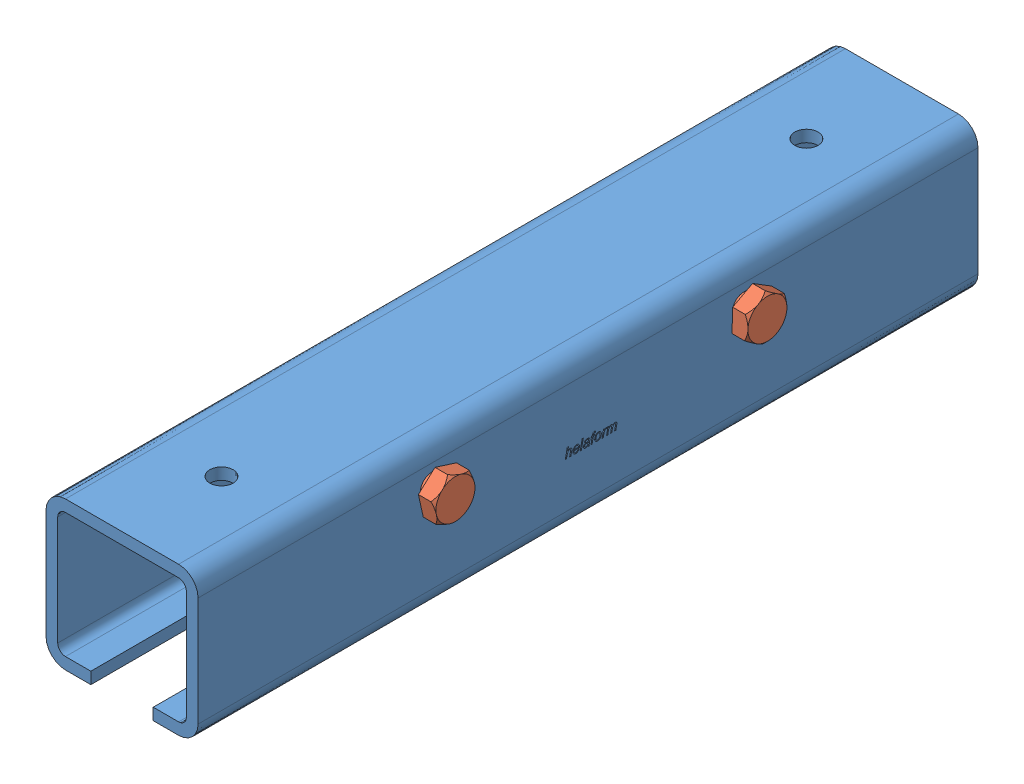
SolidWorks assembly 30092.SLDASM, configuration Default (file format 4400). Lengths in mm.
Overall size (45 38 200).
3 component instances, 2 part files, 4 mates.
Components (placement in the parent):
- 96003_200mm-1: 96003_200mm.SLDPRT [Default] at origin size (39 38 200)
- 96501-1: 96501.SLDPRT [M6x12] at (23.5 -10 -40) x (0 0.850203 -0.526455) z (-1 0 0) size (10 12.7 16.3)
- 96501-2: 96501.SLDPRT [M6x12] at (23.5 -10 40) x (0 -0.216106 0.97637) z (-1 0 0) size (10 12.7 16.3)
Mates (geometry in assembly coordinates):
- Concentric2: concentric aligned: cylinder of 96003_200mm-1 through (-19.501 -10 -40) axis (1 0 0) radius 3; cylinder of 96501-1 through (9.2 -10 -40) axis (1 0 0) radius 3
- Distance1: distance = 2 mm anti-aligned: plane of 96003_200mm-1 through (19.5 -5 100) normal (1 0 0); plane of 96501-1 through (21.5 -13.0395 -44.9086) normal (-1 0 0)
- Concentric3: concentric aligned: cylinder of 96003_200mm-1 through (-19.501 -10 40) axis (1 0 0) radius 3; cylinder of 96501-2 through (9.2 -10 40) axis (1 0 0) radius 3
- Distance2: distance = 2 mm anti-aligned: plane of 96003_200mm-1 through (19.5 -5 100) normal (1 0 0); plane of 96501-2 through (21.5 -4.3629 41.2477) normal (-1 0 0)
